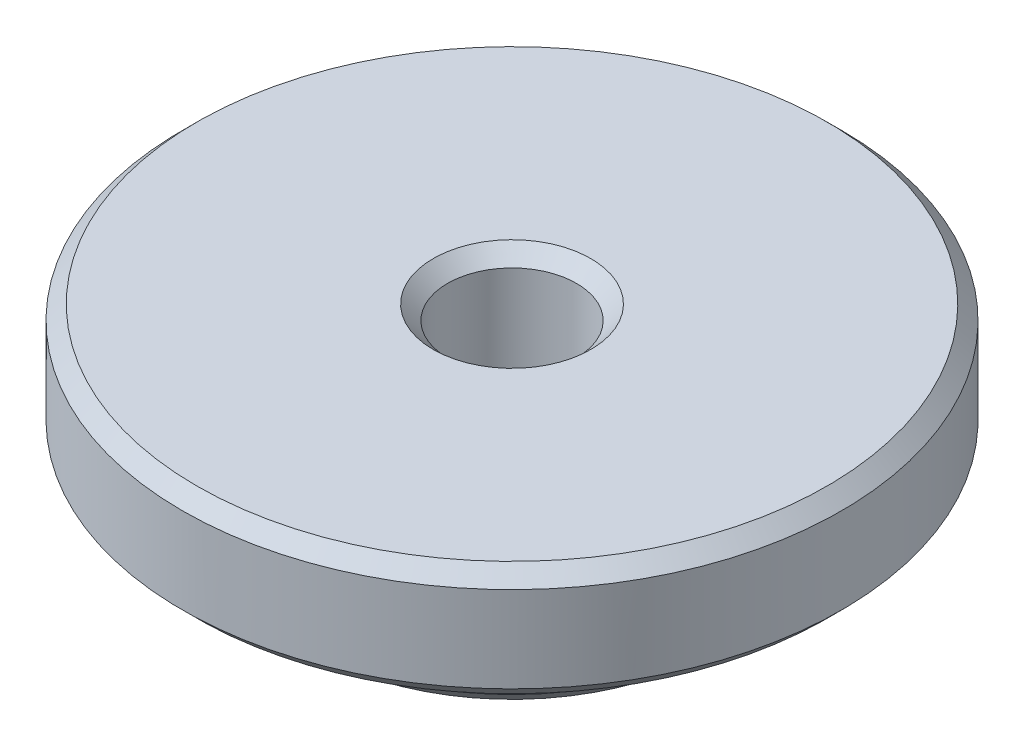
ISO-10303-21;
HEADER;
FILE_DESCRIPTION(('STEP AP214'),'2;1');
FILE_NAME('part.step','',(''),(''),'','','');
FILE_SCHEMA(('AUTOMOTIVE_DESIGN { 1 0 10303 214 1 1 1 1 }'));
ENDSEC;
DATA;
#1=APPLICATION_CONTEXT('core data for automotive mechanical design processes');
#2=APPLICATION_PROTOCOL_DEFINITION('international standard','automotive_design',2000,#1);
#3=PRODUCT_CONTEXT('',#1,'mechanical');
#4=PRODUCT('Part','Part','',(#3));
#5=PRODUCT_RELATED_PRODUCT_CATEGORY('part','',(#4));
#6=PRODUCT_DEFINITION_FORMATION('','',#4);
#7=PRODUCT_DEFINITION_CONTEXT('part definition',#1,'design');
#8=PRODUCT_DEFINITION('design','',#6,#7);
#9=PRODUCT_DEFINITION_SHAPE('','',#8);
#10=(LENGTH_UNIT() NAMED_UNIT(*) SI_UNIT(.MILLI.,.METRE.));
#11=(NAMED_UNIT(*) PLANE_ANGLE_UNIT() SI_UNIT($,.RADIAN.));
#12=(NAMED_UNIT(*) SI_UNIT($,.STERADIAN.) SOLID_ANGLE_UNIT());
#13=UNCERTAINTY_MEASURE_WITH_UNIT(LENGTH_MEASURE(1.E-05),#10,'distance_accuracy_value','');
#14=(GEOMETRIC_REPRESENTATION_CONTEXT(3) GLOBAL_UNCERTAINTY_ASSIGNED_CONTEXT((#13)) GLOBAL_UNIT_ASSIGNED_CONTEXT((#10,
#11,#12)) REPRESENTATION_CONTEXT('',''));
#15=CARTESIAN_POINT('',(0.,0.,0.));
#16=DIRECTION('',(0.,0.,1.));
#17=DIRECTION('',(1.,0.,0.));
#18=AXIS2_PLACEMENT_3D('',#15,#16,#17);
#19=CARTESIAN_POINT('',(0.,0.,0.));
#20=DIRECTION('',(0.,-1.,0.));
#21=DIRECTION('',(0.,0.,-1.));
#22=AXIS2_PLACEMENT_3D('',#19,#20,#21);
#23=PLANE('',#22);
#24=CARTESIAN_POINT('',(0.,0.,0.));
#25=DIRECTION('',(0.,-1.,0.));
#26=DIRECTION('',(0.,0.,-1.));
#27=AXIS2_PLACEMENT_3D('',#24,#25,#26);
#28=CIRCLE('',#27,14.);
#29=CARTESIAN_POINT('',(0.,0.,-14.));
#30=VERTEX_POINT('',#29);
#31=EDGE_CURVE('E35',#30,#30,#28,.T.);
#32=ORIENTED_EDGE('',*,*,#31,.T.);
#33=EDGE_LOOP('',(#32));
#34=FACE_BOUND('',#33,.T.);
#35=CARTESIAN_POINT('',(0.,0.,0.));
#36=DIRECTION('',(0.,-1.,0.));
#37=DIRECTION('',(0.,0.,-1.));
#38=AXIS2_PLACEMENT_3D('',#35,#36,#37);
#39=CIRCLE('',#38,5.50000000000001);
#40=CARTESIAN_POINT('',(0.,0.,-5.50000000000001));
#41=VERTEX_POINT('',#40);
#42=EDGE_CURVE('E39',#41,#41,#39,.F.);
#43=ORIENTED_EDGE('',*,*,#42,.T.);
#44=EDGE_LOOP('',(#43));
#45=FACE_BOUND('',#44,.T.);
#46=ADVANCED_FACE('F28',(#34,#45),#23,.T.);
#47=CARTESIAN_POINT('',(0.,0.,0.));
#48=DIRECTION('',(0.,-1.,0.));
#49=DIRECTION('',(0.,0.,-1.));
#50=AXIS2_PLACEMENT_3D('',#47,#48,#49);
#51=CYLINDRICAL_SURFACE('',#50,15.);
#52=CARTESIAN_POINT('',(0.,1.,0.));
#53=DIRECTION('',(0.,-1.,0.));
#54=DIRECTION('',(0.,0.,-1.));
#55=AXIS2_PLACEMENT_3D('',#52,#53,#54);
#56=CIRCLE('',#55,15.);
#57=CARTESIAN_POINT('',(0.,1.,-15.));
#58=VERTEX_POINT('',#57);
#59=EDGE_CURVE('E10',#58,#58,#56,.F.);
#60=ORIENTED_EDGE('',*,*,#59,.T.);
#61=EDGE_LOOP('',(#60));
#62=FACE_BOUND('',#61,.T.);
#63=CARTESIAN_POINT('',(0.,6.,0.));
#64=DIRECTION('',(0.,-1.,0.));
#65=DIRECTION('',(0.,0.,-1.));
#66=AXIS2_PLACEMENT_3D('',#63,#64,#65);
#67=CIRCLE('',#66,15.);
#68=CARTESIAN_POINT('',(0.,6.,-15.));
#69=VERTEX_POINT('',#68);
#70=EDGE_CURVE('E66',#69,#69,#67,.T.);
#71=ORIENTED_EDGE('',*,*,#70,.T.);
#72=EDGE_LOOP('',(#71));
#73=FACE_BOUND('',#72,.T.);
#74=ADVANCED_FACE('F70',(#62,#73),#51,.T.);
#75=CARTESIAN_POINT('',(15.,6.,0.));
#76=DIRECTION('',(0.,-1.,0.));
#77=DIRECTION('',(0.,0.,-1.));
#78=AXIS2_PLACEMENT_3D('',#75,#76,#77);
#79=PLANE('',#78);
#80=CARTESIAN_POINT('',(0.,6.,0.));
#81=DIRECTION('',(0.,-1.,0.));
#82=DIRECTION('',(0.,0.,-1.));
#83=AXIS2_PLACEMENT_3D('',#80,#81,#82);
#84=CIRCLE('',#83,22.);
#85=CARTESIAN_POINT('',(0.,6.,-22.));
#86=VERTEX_POINT('',#85);
#87=EDGE_CURVE('E43',#86,#86,#84,.T.);
#88=ORIENTED_EDGE('',*,*,#87,.T.);
#89=EDGE_LOOP('',(#88));
#90=FACE_BOUND('',#89,.T.);
#91=ORIENTED_EDGE('',*,*,#70,.F.);
#92=EDGE_LOOP('',(#91));
#93=FACE_BOUND('',#92,.T.);
#94=ADVANCED_FACE('F72',(#90,#93),#79,.T.);
#95=CARTESIAN_POINT('',(0.,0.,0.));
#96=DIRECTION('',(0.,-1.,0.));
#97=DIRECTION('',(0.,0.,-1.));
#98=AXIS2_PLACEMENT_3D('',#95,#96,#97);
#99=CYLINDRICAL_SURFACE('',#98,23.);
#100=CARTESIAN_POINT('',(0.,13.,0.));
#101=DIRECTION('',(0.,1.,0.));
#102=DIRECTION('',(0.,0.,1.));
#103=AXIS2_PLACEMENT_3D('',#100,#101,#102);
#104=CIRCLE('',#103,23.);
#105=CARTESIAN_POINT('',(0.,13.,23.));
#106=VERTEX_POINT('',#105);
#107=EDGE_CURVE('E48',#106,#106,#104,.F.);
#108=ORIENTED_EDGE('',*,*,#107,.T.);
#109=EDGE_LOOP('',(#108));
#110=FACE_BOUND('',#109,.T.);
#111=CARTESIAN_POINT('',(0.,7.00000000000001,0.));
#112=DIRECTION('',(0.,-1.,0.));
#113=DIRECTION('',(0.,0.,-1.));
#114=AXIS2_PLACEMENT_3D('',#111,#112,#113);
#115=CIRCLE('',#114,23.);
#116=CARTESIAN_POINT('',(0.,7.00000000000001,-23.));
#117=VERTEX_POINT('',#116);
#118=EDGE_CURVE('E51',#117,#117,#115,.F.);
#119=ORIENTED_EDGE('',*,*,#118,.T.);
#120=EDGE_LOOP('',(#119));
#121=FACE_BOUND('',#120,.T.);
#122=ADVANCED_FACE('F74',(#110,#121),#99,.T.);
#123=CARTESIAN_POINT('',(23.,14.,0.));
#124=DIRECTION('',(0.,1.,0.));
#125=DIRECTION('',(0.,0.,1.));
#126=AXIS2_PLACEMENT_3D('',#123,#124,#125);
#127=PLANE('',#126);
#128=CARTESIAN_POINT('',(0.,14.,0.));
#129=DIRECTION('',(0.,1.,0.));
#130=DIRECTION('',(0.,0.,1.));
#131=AXIS2_PLACEMENT_3D('',#128,#129,#130);
#132=CIRCLE('',#131,5.50000000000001);
#133=CARTESIAN_POINT('',(0.,14.,5.50000000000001));
#134=VERTEX_POINT('',#133);
#135=EDGE_CURVE('E54',#134,#134,#132,.F.);
#136=ORIENTED_EDGE('',*,*,#135,.T.);
#137=EDGE_LOOP('',(#136));
#138=FACE_BOUND('',#137,.T.);
#139=CARTESIAN_POINT('',(0.,14.,0.));
#140=DIRECTION('',(0.,1.,0.));
#141=DIRECTION('',(0.,0.,1.));
#142=AXIS2_PLACEMENT_3D('',#139,#140,#141);
#143=CIRCLE('',#142,22.);
#144=CARTESIAN_POINT('',(0.,14.,22.));
#145=VERTEX_POINT('',#144);
#146=EDGE_CURVE('E57',#145,#145,#143,.T.);
#147=ORIENTED_EDGE('',*,*,#146,.T.);
#148=EDGE_LOOP('',(#147));
#149=FACE_BOUND('',#148,.T.);
#150=ADVANCED_FACE('F81',(#138,#149),#127,.T.);
#151=CARTESIAN_POINT('',(0.,0.,0.));
#152=DIRECTION('',(0.,1.,0.));
#153=DIRECTION('',(0.,0.,1.));
#154=AXIS2_PLACEMENT_3D('',#151,#152,#153);
#155=CYLINDRICAL_SURFACE('',#154,4.5);
#156=CARTESIAN_POINT('',(0.,13.,0.));
#157=DIRECTION('',(0.,1.,0.));
#158=DIRECTION('',(0.,0.,1.));
#159=AXIS2_PLACEMENT_3D('',#156,#157,#158);
#160=CIRCLE('',#159,4.5);
#161=CARTESIAN_POINT('',(0.,13.,4.5));
#162=VERTEX_POINT('',#161);
#163=EDGE_CURVE('E60',#162,#162,#160,.T.);
#164=ORIENTED_EDGE('',*,*,#163,.T.);
#165=EDGE_LOOP('',(#164));
#166=FACE_BOUND('',#165,.T.);
#167=CARTESIAN_POINT('',(0.,1.00000000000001,0.));
#168=DIRECTION('',(0.,-1.,0.));
#169=DIRECTION('',(0.,0.,-1.));
#170=AXIS2_PLACEMENT_3D('',#167,#168,#169);
#171=CIRCLE('',#170,4.5);
#172=CARTESIAN_POINT('',(0.,1.00000000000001,-4.5));
#173=VERTEX_POINT('',#172);
#174=EDGE_CURVE('E63',#173,#173,#171,.T.);
#175=ORIENTED_EDGE('',*,*,#174,.T.);
#176=EDGE_LOOP('',(#175));
#177=FACE_BOUND('',#176,.T.);
#178=ADVANCED_FACE('F95',(#166,#177),#155,.F.);
#179=CARTESIAN_POINT('',(0.,13.,0.));
#180=DIRECTION('',(0.,1.,0.));
#181=DIRECTION('',(0.,0.,1.));
#182=AXIS2_PLACEMENT_3D('',#179,#180,#181);
#183=CONICAL_SURFACE('',#182,4.5,0.78539816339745);
#184=ORIENTED_EDGE('',*,*,#135,.F.);
#185=EDGE_LOOP('',(#184));
#186=FACE_BOUND('',#185,.T.);
#187=ORIENTED_EDGE('',*,*,#163,.F.);
#188=EDGE_LOOP('',(#187));
#189=FACE_BOUND('',#188,.T.);
#190=ADVANCED_FACE('F91',(#186,#189),#183,.F.);
#191=CARTESIAN_POINT('',(0.,13.,0.));
#192=DIRECTION('',(0.,-1.,0.));
#193=DIRECTION('',(0.,0.,-1.));
#194=AXIS2_PLACEMENT_3D('',#191,#192,#193);
#195=CONICAL_SURFACE('',#194,23.,0.785398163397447);
#196=ORIENTED_EDGE('',*,*,#146,.F.);
#197=EDGE_LOOP('',(#196));
#198=FACE_BOUND('',#197,.T.);
#199=ORIENTED_EDGE('',*,*,#107,.F.);
#200=EDGE_LOOP('',(#199));
#201=FACE_BOUND('',#200,.T.);
#202=ADVANCED_FACE('F94',(#198,#201),#195,.T.);
#203=CARTESIAN_POINT('',(0.,6.,0.));
#204=DIRECTION('',(0.,1.,0.));
#205=DIRECTION('',(0.,0.,1.));
#206=AXIS2_PLACEMENT_3D('',#203,#204,#205);
#207=CONICAL_SURFACE('',#206,22.,0.785398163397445);
#208=ORIENTED_EDGE('',*,*,#118,.F.);
#209=EDGE_LOOP('',(#208));
#210=FACE_BOUND('',#209,.T.);
#211=ORIENTED_EDGE('',*,*,#87,.F.);
#212=EDGE_LOOP('',(#211));
#213=FACE_BOUND('',#212,.T.);
#214=ADVANCED_FACE('F99',(#210,#213),#207,.T.);
#215=CARTESIAN_POINT('',(0.,0.,0.));
#216=DIRECTION('',(0.,1.,0.));
#217=DIRECTION('',(0.,0.,1.));
#218=AXIS2_PLACEMENT_3D('',#215,#216,#217);
#219=CONICAL_SURFACE('',#218,14.,0.785398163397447);
#220=ORIENTED_EDGE('',*,*,#59,.F.);
#221=EDGE_LOOP('',(#220));
#222=FACE_BOUND('',#221,.T.);
#223=ORIENTED_EDGE('',*,*,#31,.F.);
#224=EDGE_LOOP('',(#223));
#225=FACE_BOUND('',#224,.T.);
#226=ADVANCED_FACE('F102',(#222,#225),#219,.T.);
#227=CARTESIAN_POINT('',(0.,0.,0.));
#228=DIRECTION('',(0.,-1.,0.));
#229=DIRECTION('',(0.,0.,-1.));
#230=AXIS2_PLACEMENT_3D('',#227,#228,#229);
#231=CONICAL_SURFACE('',#230,5.50000000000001,0.785398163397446);
#232=ORIENTED_EDGE('',*,*,#174,.F.);
#233=EDGE_LOOP('',(#232));
#234=FACE_BOUND('',#233,.T.);
#235=ORIENTED_EDGE('',*,*,#42,.F.);
#236=EDGE_LOOP('',(#235));
#237=FACE_BOUND('',#236,.T.);
#238=ADVANCED_FACE('F30',(#234,#237),#231,.F.);
#239=CLOSED_SHELL('',(#46,#74,#94,#122,#150,#178,#190,#202,#214,#226,#238));
#240=MANIFOLD_SOLID_BREP('B2',#239);
#241=ADVANCED_BREP_SHAPE_REPRESENTATION('',(#18,#240),#14);
#242=SHAPE_DEFINITION_REPRESENTATION(#9,#241);
ENDSEC;
END-ISO-10303-21;
